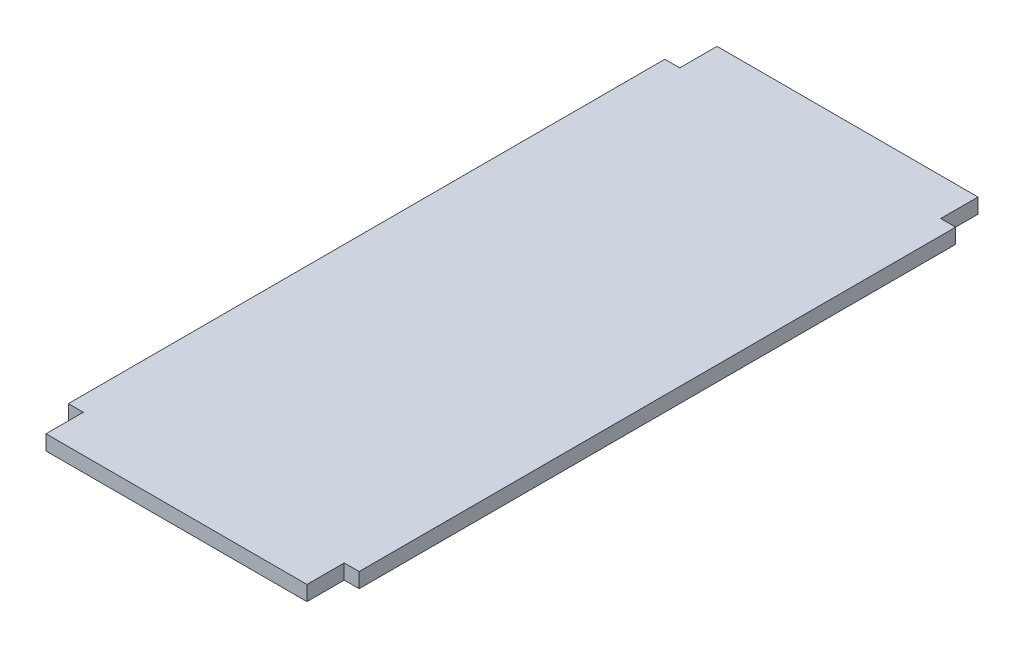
ISO-10303-21;
HEADER;
FILE_DESCRIPTION(('STEP AP214'),'2;1');
FILE_NAME('part.step','',(''),(''),'','','');
FILE_SCHEMA(('AUTOMOTIVE_DESIGN { 1 0 10303 214 1 1 1 1 }'));
ENDSEC;
DATA;
#1=APPLICATION_CONTEXT('core data for automotive mechanical design processes');
#2=APPLICATION_PROTOCOL_DEFINITION('international standard','automotive_design',2000,#1);
#3=PRODUCT_CONTEXT('',#1,'mechanical');
#4=PRODUCT('Part','Part','',(#3));
#5=PRODUCT_RELATED_PRODUCT_CATEGORY('part','',(#4));
#6=PRODUCT_DEFINITION_FORMATION('','',#4);
#7=PRODUCT_DEFINITION_CONTEXT('part definition',#1,'design');
#8=PRODUCT_DEFINITION('design','',#6,#7);
#9=PRODUCT_DEFINITION_SHAPE('','',#8);
#10=(LENGTH_UNIT() NAMED_UNIT(*) SI_UNIT(.MILLI.,.METRE.));
#11=(NAMED_UNIT(*) PLANE_ANGLE_UNIT() SI_UNIT($,.RADIAN.));
#12=(NAMED_UNIT(*) SI_UNIT($,.STERADIAN.) SOLID_ANGLE_UNIT());
#13=UNCERTAINTY_MEASURE_WITH_UNIT(LENGTH_MEASURE(1.E-05),#10,'distance_accuracy_value','');
#14=(GEOMETRIC_REPRESENTATION_CONTEXT(3) GLOBAL_UNCERTAINTY_ASSIGNED_CONTEXT((#13)) GLOBAL_UNIT_ASSIGNED_CONTEXT((#10,
#11,#12)) REPRESENTATION_CONTEXT('',''));
#15=CARTESIAN_POINT('',(0.,0.,0.));
#16=DIRECTION('',(0.,0.,1.));
#17=DIRECTION('',(1.,0.,0.));
#18=AXIS2_PLACEMENT_3D('',#15,#16,#17);
#19=CARTESIAN_POINT('',(35.,2.,0.));
#20=DIRECTION('',(-1.,0.,0.));
#21=DIRECTION('',(0.,0.,1.));
#22=AXIS2_PLACEMENT_3D('',#19,#20,#21);
#23=PLANE('',#22);
#24=DIRECTION('',(0.,0.,-1.));
#25=VECTOR('',#24,1.);
#26=CARTESIAN_POINT('',(35.,0.,0.));
#27=LINE('',#26,#25);
#28=CARTESIAN_POINT('',(35.,0.,-85.));
#29=VERTEX_POINT('',#28);
#30=CARTESIAN_POINT('',(35.,0.,-90.));
#31=VERTEX_POINT('',#30);
#32=EDGE_CURVE('E169',#29,#31,#27,.T.);
#33=ORIENTED_EDGE('',*,*,#32,.T.);
#34=DIRECTION('',(0.,-1.,0.));
#35=VECTOR('',#34,1.);
#36=CARTESIAN_POINT('',(35.,2.,-90.));
#37=LINE('',#36,#35);
#38=CARTESIAN_POINT('',(35.,2.,-90.));
#39=VERTEX_POINT('',#38);
#40=EDGE_CURVE('E178',#39,#31,#37,.T.);
#41=ORIENTED_EDGE('',*,*,#40,.F.);
#42=DIRECTION('',(0.,0.,-1.));
#43=VECTOR('',#42,1.);
#44=CARTESIAN_POINT('',(35.,2.,0.));
#45=LINE('',#44,#43);
#46=CARTESIAN_POINT('',(35.,2.,-85.));
#47=VERTEX_POINT('',#46);
#48=EDGE_CURVE('E226',#47,#39,#45,.T.);
#49=ORIENTED_EDGE('',*,*,#48,.F.);
#50=DIRECTION('',(0.,-1.,0.));
#51=VECTOR('',#50,1.);
#52=CARTESIAN_POINT('',(35.,2.,-85.));
#53=LINE('',#52,#51);
#54=EDGE_CURVE('E181',#47,#29,#53,.T.);
#55=ORIENTED_EDGE('',*,*,#54,.T.);
#56=EDGE_LOOP('',(#33,#41,#49,#55));
#57=FACE_BOUND('',#56,.T.);
#58=ADVANCED_FACE('F71',(#57),#23,.F.);
#59=CARTESIAN_POINT('',(-5.89805981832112E-13,2.,-84.9999999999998));
#60=DIRECTION('',(0.,0.,-1.));
#61=DIRECTION('',(-1.,0.,0.));
#62=AXIS2_PLACEMENT_3D('',#59,#60,#61);
#63=PLANE('',#62);
#64=DIRECTION('',(1.,0.,0.));
#65=VECTOR('',#64,1.);
#66=CARTESIAN_POINT('',(-5.89805981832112E-13,0.,-84.9999999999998));
#67=LINE('',#66,#65);
#68=CARTESIAN_POINT('',(37.,0.,-85.));
#69=VERTEX_POINT('',#68);
#70=EDGE_CURVE('E215',#29,#69,#67,.T.);
#71=ORIENTED_EDGE('',*,*,#70,.F.);
#72=ORIENTED_EDGE('',*,*,#54,.F.);
#73=DIRECTION('',(1.,0.,0.));
#74=VECTOR('',#73,1.);
#75=CARTESIAN_POINT('',(-5.89805981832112E-13,2.,-84.9999999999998));
#76=LINE('',#75,#74);
#77=CARTESIAN_POINT('',(37.,2.,-85.));
#78=VERTEX_POINT('',#77);
#79=EDGE_CURVE('E227',#47,#78,#76,.T.);
#80=ORIENTED_EDGE('',*,*,#79,.T.);
#81=DIRECTION('',(0.,-1.,0.));
#82=VECTOR('',#81,1.);
#83=CARTESIAN_POINT('',(37.,2.,-85.));
#84=LINE('',#83,#82);
#85=EDGE_CURVE('E184',#78,#69,#84,.T.);
#86=ORIENTED_EDGE('',*,*,#85,.T.);
#87=EDGE_LOOP('',(#71,#72,#80,#86));
#88=FACE_BOUND('',#87,.T.);
#89=ADVANCED_FACE('F275',(#88),#63,.T.);
#90=CARTESIAN_POINT('',(37.,2.,0.));
#91=DIRECTION('',(1.,0.,0.));
#92=DIRECTION('',(0.,0.,-1.));
#93=AXIS2_PLACEMENT_3D('',#90,#91,#92);
#94=PLANE('',#93);
#95=DIRECTION('',(0.,0.,1.));
#96=VECTOR('',#95,1.);
#97=CARTESIAN_POINT('',(37.,0.,0.));
#98=LINE('',#97,#96);
#99=CARTESIAN_POINT('',(37.,0.,-5.));
#100=VERTEX_POINT('',#99);
#101=EDGE_CURVE('E197',#69,#100,#98,.T.);
#102=ORIENTED_EDGE('',*,*,#101,.F.);
#103=ORIENTED_EDGE('',*,*,#85,.F.);
#104=DIRECTION('',(0.,0.,1.));
#105=VECTOR('',#104,1.);
#106=CARTESIAN_POINT('',(37.,2.,0.));
#107=LINE('',#106,#105);
#108=CARTESIAN_POINT('',(37.,2.,-5.));
#109=VERTEX_POINT('',#108);
#110=EDGE_CURVE('E201',#78,#109,#107,.T.);
#111=ORIENTED_EDGE('',*,*,#110,.T.);
#112=DIRECTION('',(0.,-1.,0.));
#113=VECTOR('',#112,1.);
#114=CARTESIAN_POINT('',(37.,2.,-5.));
#115=LINE('',#114,#113);
#116=EDGE_CURVE('E151',#109,#100,#115,.T.);
#117=ORIENTED_EDGE('',*,*,#116,.T.);
#118=EDGE_LOOP('',(#102,#103,#111,#117));
#119=FACE_BOUND('',#118,.T.);
#120=ADVANCED_FACE('F193',(#119),#94,.T.);
#121=CARTESIAN_POINT('',(0.,2.,-5.));
#122=DIRECTION('',(0.,0.,-1.));
#123=DIRECTION('',(-1.,0.,0.));
#124=AXIS2_PLACEMENT_3D('',#121,#122,#123);
#125=PLANE('',#124);
#126=DIRECTION('',(1.,0.,0.));
#127=VECTOR('',#126,1.);
#128=CARTESIAN_POINT('',(0.,0.,-5.));
#129=LINE('',#128,#127);
#130=CARTESIAN_POINT('',(35.,0.,-5.));
#131=VERTEX_POINT('',#130);
#132=EDGE_CURVE('E207',#131,#100,#129,.T.);
#133=ORIENTED_EDGE('',*,*,#132,.T.);
#134=ORIENTED_EDGE('',*,*,#116,.F.);
#135=DIRECTION('',(1.,0.,0.));
#136=VECTOR('',#135,1.);
#137=CARTESIAN_POINT('',(0.,2.,-5.));
#138=LINE('',#137,#136);
#139=CARTESIAN_POINT('',(35.,2.,-5.));
#140=VERTEX_POINT('',#139);
#141=EDGE_CURVE('E231',#140,#109,#138,.T.);
#142=ORIENTED_EDGE('',*,*,#141,.F.);
#143=DIRECTION('',(0.,-1.,0.));
#144=VECTOR('',#143,1.);
#145=CARTESIAN_POINT('',(35.,2.,-5.));
#146=LINE('',#145,#144);
#147=EDGE_CURVE('E143',#140,#131,#146,.T.);
#148=ORIENTED_EDGE('',*,*,#147,.T.);
#149=EDGE_LOOP('',(#133,#134,#142,#148));
#150=FACE_BOUND('',#149,.T.);
#151=ADVANCED_FACE('F208',(#150),#125,.F.);
#152=CARTESIAN_POINT('',(35.,0.,0.));
#153=VERTEX_POINT('',#152);
#154=EDGE_CURVE('E211',#153,#131,#27,.T.);
#155=ORIENTED_EDGE('',*,*,#154,.T.);
#156=ORIENTED_EDGE('',*,*,#147,.F.);
#157=CARTESIAN_POINT('',(35.,2.,0.));
#158=VERTEX_POINT('',#157);
#159=EDGE_CURVE('E234',#158,#140,#45,.T.);
#160=ORIENTED_EDGE('',*,*,#159,.F.);
#161=DIRECTION('',(0.,-1.,0.));
#162=VECTOR('',#161,1.);
#163=CARTESIAN_POINT('',(35.,2.,0.));
#164=LINE('',#163,#162);
#165=EDGE_CURVE('E139',#158,#153,#164,.T.);
#166=ORIENTED_EDGE('',*,*,#165,.T.);
#167=EDGE_LOOP('',(#155,#156,#160,#166));
#168=FACE_BOUND('',#167,.T.);
#169=ADVANCED_FACE('F293',(#168),#23,.F.);
#170=CARTESIAN_POINT('',(0.,2.,-90.));
#171=DIRECTION('',(0.,0.,-1.));
#172=DIRECTION('',(-1.,0.,0.));
#173=AXIS2_PLACEMENT_3D('',#170,#171,#172);
#174=PLANE('',#173);
#175=DIRECTION('',(1.,0.,0.));
#176=VECTOR('',#175,1.);
#177=CARTESIAN_POINT('',(0.,0.,-90.));
#178=LINE('',#177,#176);
#179=CARTESIAN_POINT('',(0.,0.,-90.));
#180=VERTEX_POINT('',#179);
#181=EDGE_CURVE('E166',#180,#31,#178,.T.);
#182=ORIENTED_EDGE('',*,*,#181,.F.);
#183=DIRECTION('',(0.,-1.,0.));
#184=VECTOR('',#183,1.);
#185=CARTESIAN_POINT('',(0.,2.,-90.));
#186=LINE('',#185,#184);
#187=CARTESIAN_POINT('',(0.,2.,-90.));
#188=VERTEX_POINT('',#187);
#189=EDGE_CURVE('E164',#188,#180,#186,.T.);
#190=ORIENTED_EDGE('',*,*,#189,.F.);
#191=DIRECTION('',(1.,0.,0.));
#192=VECTOR('',#191,1.);
#193=CARTESIAN_POINT('',(0.,2.,-90.));
#194=LINE('',#193,#192);
#195=EDGE_CURVE('E223',#188,#39,#194,.T.);
#196=ORIENTED_EDGE('',*,*,#195,.T.);
#197=ORIENTED_EDGE('',*,*,#40,.T.);
#198=EDGE_LOOP('',(#182,#190,#196,#197));
#199=FACE_BOUND('',#198,.T.);
#200=ADVANCED_FACE('F269',(#199),#174,.T.);
#201=CARTESIAN_POINT('',(0.,2.,0.));
#202=DIRECTION('',(0.,0.,-1.));
#203=DIRECTION('',(-1.,0.,0.));
#204=AXIS2_PLACEMENT_3D('',#201,#202,#203);
#205=PLANE('',#204);
#206=DIRECTION('',(1.,0.,0.));
#207=VECTOR('',#206,1.);
#208=CARTESIAN_POINT('',(0.,0.,0.));
#209=LINE('',#208,#207);
#210=CARTESIAN_POINT('',(0.,0.,0.));
#211=VERTEX_POINT('',#210);
#212=EDGE_CURVE('E219',#211,#153,#209,.T.);
#213=ORIENTED_EDGE('',*,*,#212,.T.);
#214=ORIENTED_EDGE('',*,*,#165,.F.);
#215=DIRECTION('',(1.,0.,0.));
#216=VECTOR('',#215,1.);
#217=CARTESIAN_POINT('',(0.,2.,0.));
#218=LINE('',#217,#216);
#219=CARTESIAN_POINT('',(0.,2.,0.));
#220=VERTEX_POINT('',#219);
#221=EDGE_CURVE('E168',#220,#158,#218,.T.);
#222=ORIENTED_EDGE('',*,*,#221,.F.);
#223=DIRECTION('',(0.,-1.,0.));
#224=VECTOR('',#223,1.);
#225=CARTESIAN_POINT('',(0.,2.,0.));
#226=LINE('',#225,#224);
#227=EDGE_CURVE('E173',#220,#211,#226,.T.);
#228=ORIENTED_EDGE('',*,*,#227,.T.);
#229=EDGE_LOOP('',(#213,#214,#222,#228));
#230=FACE_BOUND('',#229,.T.);
#231=ADVANCED_FACE('F248',(#230),#205,.F.);
#232=CARTESIAN_POINT('',(0.,0.,0.));
#233=DIRECTION('',(0.,1.,0.));
#234=DIRECTION('',(0.,0.,1.));
#235=AXIS2_PLACEMENT_3D('',#232,#233,#234);
#236=PLANE('',#235);
#237=ORIENTED_EDGE('',*,*,#212,.F.);
#238=DIRECTION('',(0.,0.,-1.));
#239=VECTOR('',#238,1.);
#240=CARTESIAN_POINT('',(0.,0.,0.));
#241=LINE('',#240,#239);
#242=CARTESIAN_POINT('',(0.,0.,-4.99999999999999));
#243=VERTEX_POINT('',#242);
#244=EDGE_CURVE('E130',#211,#243,#241,.T.);
#245=ORIENTED_EDGE('',*,*,#244,.T.);
#246=DIRECTION('',(-1.,0.,0.));
#247=VECTOR('',#246,1.);
#248=CARTESIAN_POINT('',(0.,0.,-4.99999999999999));
#249=LINE('',#248,#247);
#250=CARTESIAN_POINT('',(-2.,0.,-4.99999999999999));
#251=VERTEX_POINT('',#250);
#252=EDGE_CURVE('E117',#243,#251,#249,.T.);
#253=ORIENTED_EDGE('',*,*,#252,.T.);
#254=DIRECTION('',(0.,0.,1.));
#255=VECTOR('',#254,1.);
#256=CARTESIAN_POINT('',(-2.00000000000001,0.,-85.));
#257=LINE('',#256,#255);
#258=CARTESIAN_POINT('',(-2.00000000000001,0.,-85.));
#259=VERTEX_POINT('',#258);
#260=EDGE_CURVE('E107',#259,#251,#257,.T.);
#261=ORIENTED_EDGE('',*,*,#260,.F.);
#262=DIRECTION('',(-1.,0.,0.));
#263=VECTOR('',#262,1.);
#264=CARTESIAN_POINT('',(0.,0.,-85.));
#265=LINE('',#264,#263);
#266=CARTESIAN_POINT('',(0.,0.,-85.));
#267=VERTEX_POINT('',#266);
#268=EDGE_CURVE('E125',#267,#259,#265,.T.);
#269=ORIENTED_EDGE('',*,*,#268,.F.);
#270=EDGE_CURVE('E160',#267,#180,#241,.T.);
#271=ORIENTED_EDGE('',*,*,#270,.T.);
#272=ORIENTED_EDGE('',*,*,#181,.T.);
#273=ORIENTED_EDGE('',*,*,#32,.F.);
#274=ORIENTED_EDGE('',*,*,#70,.T.);
#275=ORIENTED_EDGE('',*,*,#101,.T.);
#276=ORIENTED_EDGE('',*,*,#132,.F.);
#277=ORIENTED_EDGE('',*,*,#154,.F.);
#278=EDGE_LOOP('',(#237,#245,#253,#261,#269,#271,#272,#273,#274,#275,#276,#277));
#279=FACE_BOUND('',#278,.T.);
#280=ADVANCED_FACE('F128',(#279),#236,.F.);
#281=CARTESIAN_POINT('',(0.,2.,0.));
#282=DIRECTION('',(0.,1.,0.));
#283=DIRECTION('',(0.,0.,1.));
#284=AXIS2_PLACEMENT_3D('',#281,#282,#283);
#285=PLANE('',#284);
#286=ORIENTED_EDGE('',*,*,#221,.T.);
#287=ORIENTED_EDGE('',*,*,#159,.T.);
#288=ORIENTED_EDGE('',*,*,#141,.T.);
#289=ORIENTED_EDGE('',*,*,#110,.F.);
#290=ORIENTED_EDGE('',*,*,#79,.F.);
#291=ORIENTED_EDGE('',*,*,#48,.T.);
#292=ORIENTED_EDGE('',*,*,#195,.F.);
#293=DIRECTION('',(0.,0.,-1.));
#294=VECTOR('',#293,1.);
#295=CARTESIAN_POINT('',(0.,2.,0.));
#296=LINE('',#295,#294);
#297=CARTESIAN_POINT('',(0.,2.,-85.));
#298=VERTEX_POINT('',#297);
#299=EDGE_CURVE('E222',#298,#188,#296,.T.);
#300=ORIENTED_EDGE('',*,*,#299,.F.);
#301=DIRECTION('',(-1.,0.,0.));
#302=VECTOR('',#301,1.);
#303=CARTESIAN_POINT('',(0.,2.,-85.));
#304=LINE('',#303,#302);
#305=CARTESIAN_POINT('',(-2.00000000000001,2.,-85.));
#306=VERTEX_POINT('',#305);
#307=EDGE_CURVE('E131',#298,#306,#304,.T.);
#308=ORIENTED_EDGE('',*,*,#307,.T.);
#309=DIRECTION('',(0.,0.,1.));
#310=VECTOR('',#309,1.);
#311=CARTESIAN_POINT('',(-2.00000000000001,2.,-85.));
#312=LINE('',#311,#310);
#313=CARTESIAN_POINT('',(-2.,2.,-4.99999999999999));
#314=VERTEX_POINT('',#313);
#315=EDGE_CURVE('E134',#306,#314,#312,.T.);
#316=ORIENTED_EDGE('',*,*,#315,.T.);
#317=DIRECTION('',(-1.,0.,0.));
#318=VECTOR('',#317,1.);
#319=CARTESIAN_POINT('',(0.,2.,-4.99999999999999));
#320=LINE('',#319,#318);
#321=CARTESIAN_POINT('',(0.,2.,-4.99999999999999));
#322=VERTEX_POINT('',#321);
#323=EDGE_CURVE('E120',#322,#314,#320,.T.);
#324=ORIENTED_EDGE('',*,*,#323,.F.);
#325=EDGE_CURVE('E176',#220,#322,#296,.T.);
#326=ORIENTED_EDGE('',*,*,#325,.F.);
#327=EDGE_LOOP('',(#286,#287,#288,#289,#290,#291,#292,#300,#308,#316,#324,#326));
#328=FACE_BOUND('',#327,.T.);
#329=ADVANCED_FACE('F242',(#328),#285,.T.);
#330=CARTESIAN_POINT('',(0.,2.,0.));
#331=DIRECTION('',(-1.,0.,0.));
#332=DIRECTION('',(0.,0.,1.));
#333=AXIS2_PLACEMENT_3D('',#330,#331,#332);
#334=PLANE('',#333);
#335=ORIENTED_EDGE('',*,*,#325,.T.);
#336=DIRECTION('',(0.,-1.,0.));
#337=VECTOR('',#336,1.);
#338=CARTESIAN_POINT('',(0.,2.,-4.99999999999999));
#339=LINE('',#338,#337);
#340=EDGE_CURVE('E81',#322,#243,#339,.T.);
#341=ORIENTED_EDGE('',*,*,#340,.T.);
#342=ORIENTED_EDGE('',*,*,#244,.F.);
#343=ORIENTED_EDGE('',*,*,#227,.F.);
#344=EDGE_LOOP('',(#335,#341,#342,#343));
#345=FACE_BOUND('',#344,.T.);
#346=ADVANCED_FACE('F252',(#345),#334,.T.);
#347=DIRECTION('',(0.,-1.,0.));
#348=VECTOR('',#347,1.);
#349=CARTESIAN_POINT('',(0.,2.,-85.));
#350=LINE('',#349,#348);
#351=EDGE_CURVE('E12',#298,#267,#350,.T.);
#352=ORIENTED_EDGE('',*,*,#351,.F.);
#353=ORIENTED_EDGE('',*,*,#299,.T.);
#354=ORIENTED_EDGE('',*,*,#189,.T.);
#355=ORIENTED_EDGE('',*,*,#270,.F.);
#356=EDGE_LOOP('',(#352,#353,#354,#355));
#357=FACE_BOUND('',#356,.T.);
#358=ADVANCED_FACE('F162',(#357),#334,.T.);
#359=CARTESIAN_POINT('',(-2.00000000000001,2.,-85.));
#360=DIRECTION('',(1.,0.,0.));
#361=DIRECTION('',(0.,0.,-1.));
#362=AXIS2_PLACEMENT_3D('',#359,#360,#361);
#363=PLANE('',#362);
#364=ORIENTED_EDGE('',*,*,#260,.T.);
#365=DIRECTION('',(0.,-1.,0.));
#366=VECTOR('',#365,1.);
#367=CARTESIAN_POINT('',(-2.,2.,-4.99999999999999));
#368=LINE('',#367,#366);
#369=EDGE_CURVE('E114',#314,#251,#368,.T.);
#370=ORIENTED_EDGE('',*,*,#369,.F.);
#371=ORIENTED_EDGE('',*,*,#315,.F.);
#372=DIRECTION('',(0.,-1.,0.));
#373=VECTOR('',#372,1.);
#374=CARTESIAN_POINT('',(-2.00000000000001,2.,-85.));
#375=LINE('',#374,#373);
#376=EDGE_CURVE('E75',#306,#259,#375,.T.);
#377=ORIENTED_EDGE('',*,*,#376,.T.);
#378=EDGE_LOOP('',(#364,#370,#371,#377));
#379=FACE_BOUND('',#378,.T.);
#380=ADVANCED_FACE('F122',(#379),#363,.F.);
#381=CARTESIAN_POINT('',(0.,2.,-4.99999999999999));
#382=DIRECTION('',(0.,0.,1.));
#383=DIRECTION('',(1.,0.,0.));
#384=AXIS2_PLACEMENT_3D('',#381,#382,#383);
#385=PLANE('',#384);
#386=ORIENTED_EDGE('',*,*,#252,.F.);
#387=ORIENTED_EDGE('',*,*,#340,.F.);
#388=ORIENTED_EDGE('',*,*,#323,.T.);
#389=ORIENTED_EDGE('',*,*,#369,.T.);
#390=EDGE_LOOP('',(#386,#387,#388,#389));
#391=FACE_BOUND('',#390,.T.);
#392=ADVANCED_FACE('F115',(#391),#385,.T.);
#393=CARTESIAN_POINT('',(0.,2.,-85.));
#394=DIRECTION('',(0.,0.,1.));
#395=DIRECTION('',(1.,0.,0.));
#396=AXIS2_PLACEMENT_3D('',#393,#394,#395);
#397=PLANE('',#396);
#398=ORIENTED_EDGE('',*,*,#268,.T.);
#399=ORIENTED_EDGE('',*,*,#376,.F.);
#400=ORIENTED_EDGE('',*,*,#307,.F.);
#401=ORIENTED_EDGE('',*,*,#351,.T.);
#402=EDGE_LOOP('',(#398,#399,#400,#401));
#403=FACE_BOUND('',#402,.T.);
#404=ADVANCED_FACE('F73',(#403),#397,.F.);
#405=CLOSED_SHELL('',(#58,#89,#120,#151,#169,#200,#231,#280,#329,#346,#358,#380,#392,#404));
#406=MANIFOLD_SOLID_BREP('B2',#405);
#407=ADVANCED_BREP_SHAPE_REPRESENTATION('',(#18,#406),#14);
#408=SHAPE_DEFINITION_REPRESENTATION(#9,#407);
ENDSEC;
END-ISO-10303-21;
